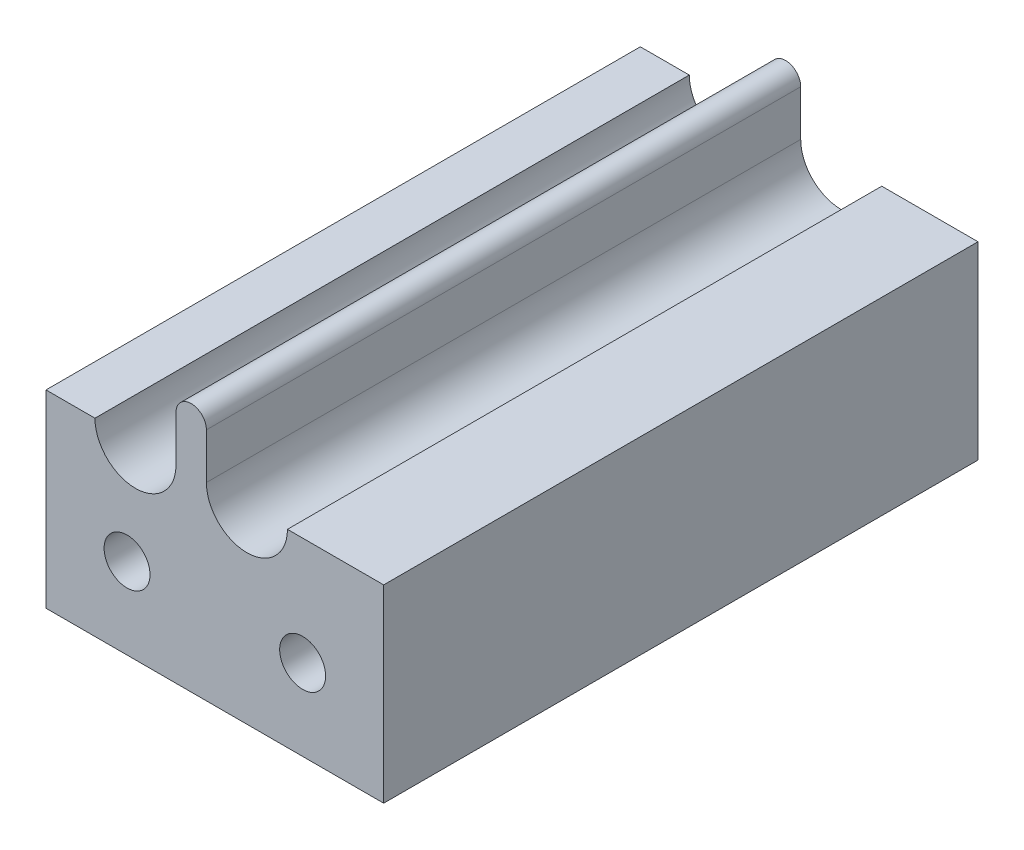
ISO-10303-21;
HEADER;
FILE_DESCRIPTION(('STEP AP214'),'2;1');
FILE_NAME('part.step','',(''),(''),'','','');
FILE_SCHEMA(('AUTOMOTIVE_DESIGN { 1 0 10303 214 1 1 1 1 }'));
ENDSEC;
DATA;
#1=APPLICATION_CONTEXT('core data for automotive mechanical design processes');
#2=APPLICATION_PROTOCOL_DEFINITION('international standard','automotive_design',2000,#1);
#3=PRODUCT_CONTEXT('',#1,'mechanical');
#4=PRODUCT('Part','Part','',(#3));
#5=PRODUCT_RELATED_PRODUCT_CATEGORY('part','',(#4));
#6=PRODUCT_DEFINITION_FORMATION('','',#4);
#7=PRODUCT_DEFINITION_CONTEXT('part definition',#1,'design');
#8=PRODUCT_DEFINITION('design','',#6,#7);
#9=PRODUCT_DEFINITION_SHAPE('','',#8);
#10=(LENGTH_UNIT() NAMED_UNIT(*) SI_UNIT(.MILLI.,.METRE.));
#11=(NAMED_UNIT(*) PLANE_ANGLE_UNIT() SI_UNIT($,.RADIAN.));
#12=(NAMED_UNIT(*) SI_UNIT($,.STERADIAN.) SOLID_ANGLE_UNIT());
#13=UNCERTAINTY_MEASURE_WITH_UNIT(LENGTH_MEASURE(1.E-05),#10,'distance_accuracy_value','');
#14=(GEOMETRIC_REPRESENTATION_CONTEXT(3) GLOBAL_UNCERTAINTY_ASSIGNED_CONTEXT((#13)) GLOBAL_UNIT_ASSIGNED_CONTEXT((#10,
#11,#12)) REPRESENTATION_CONTEXT('',''));
#15=CARTESIAN_POINT('',(0.,0.,0.));
#16=DIRECTION('',(0.,0.,1.));
#17=DIRECTION('',(1.,0.,0.));
#18=AXIS2_PLACEMENT_3D('',#15,#16,#17);
#19=CARTESIAN_POINT('',(-299.,-148.500000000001,-88.));
#20=DIRECTION('',(-1.,0.,0.));
#21=DIRECTION('',(0.,0.,1.));
#22=AXIS2_PLACEMENT_3D('',#19,#20,#21);
#23=PLANE('',#22);
#24=DIRECTION('',(0.,-1.,0.));
#25=VECTOR('',#24,1.);
#26=CARTESIAN_POINT('',(-299.,-148.500000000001,0.));
#27=LINE('',#26,#25);
#28=CARTESIAN_POINT('',(-299.,-148.500000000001,0.));
#29=VERTEX_POINT('',#28);
#30=CARTESIAN_POINT('',(-299.,-176.500000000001,0.));
#31=VERTEX_POINT('',#30);
#32=EDGE_CURVE('E195',#29,#31,#27,.T.);
#33=ORIENTED_EDGE('',*,*,#32,.F.);
#34=DIRECTION('',(0.,0.,1.));
#35=VECTOR('',#34,1.);
#36=CARTESIAN_POINT('',(-299.,-148.500000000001,-88.));
#37=LINE('',#36,#35);
#38=CARTESIAN_POINT('',(-299.,-148.500000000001,-88.));
#39=VERTEX_POINT('',#38);
#40=EDGE_CURVE('E13',#39,#29,#37,.T.);
#41=ORIENTED_EDGE('',*,*,#40,.F.);
#42=DIRECTION('',(0.,-1.,0.));
#43=VECTOR('',#42,1.);
#44=CARTESIAN_POINT('',(-299.,-148.500000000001,-88.));
#45=LINE('',#44,#43);
#46=CARTESIAN_POINT('',(-299.,-176.500000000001,-88.));
#47=VERTEX_POINT('',#46);
#48=EDGE_CURVE('E170',#39,#47,#45,.T.);
#49=ORIENTED_EDGE('',*,*,#48,.T.);
#50=DIRECTION('',(0.,0.,1.));
#51=VECTOR('',#50,1.);
#52=CARTESIAN_POINT('',(-299.,-176.500000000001,-88.));
#53=LINE('',#52,#51);
#54=EDGE_CURVE('E50',#47,#31,#53,.T.);
#55=ORIENTED_EDGE('',*,*,#54,.T.);
#56=EDGE_LOOP('',(#33,#41,#49,#55));
#57=FACE_BOUND('',#56,.T.);
#58=ADVANCED_FACE('F47',(#57),#23,.T.);
#59=CARTESIAN_POINT('',(-291.75,-148.500000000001,-88.));
#60=DIRECTION('',(0.,1.,0.));
#61=DIRECTION('',(-1.,0.,0.));
#62=AXIS2_PLACEMENT_3D('',#59,#60,#61);
#63=PLANE('',#62);
#64=DIRECTION('',(-1.,0.,0.));
#65=VECTOR('',#64,1.);
#66=CARTESIAN_POINT('',(-291.75,-148.500000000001,0.));
#67=LINE('',#66,#65);
#68=CARTESIAN_POINT('',(-291.75,-148.500000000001,0.));
#69=VERTEX_POINT('',#68);
#70=EDGE_CURVE('E162',#69,#29,#67,.T.);
#71=ORIENTED_EDGE('',*,*,#70,.F.);
#72=DIRECTION('',(0.,0.,1.));
#73=VECTOR('',#72,1.);
#74=CARTESIAN_POINT('',(-291.75,-148.500000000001,-88.));
#75=LINE('',#74,#73);
#76=CARTESIAN_POINT('',(-291.75,-148.500000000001,-88.));
#77=VERTEX_POINT('',#76);
#78=EDGE_CURVE('E55',#77,#69,#75,.T.);
#79=ORIENTED_EDGE('',*,*,#78,.F.);
#80=DIRECTION('',(-1.,0.,0.));
#81=VECTOR('',#80,1.);
#82=CARTESIAN_POINT('',(-291.75,-148.500000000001,-88.));
#83=LINE('',#82,#81);
#84=EDGE_CURVE('E184',#77,#39,#83,.T.);
#85=ORIENTED_EDGE('',*,*,#84,.T.);
#86=ORIENTED_EDGE('',*,*,#40,.T.);
#87=EDGE_LOOP('',(#71,#79,#85,#86));
#88=FACE_BOUND('',#87,.T.);
#89=ADVANCED_FACE('F254',(#88),#63,.T.);
#90=CARTESIAN_POINT('',(-285.75,-148.500000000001,-88.));
#91=DIRECTION('',(0.,0.,1.));
#92=DIRECTION('',(1.,0.,0.));
#93=AXIS2_PLACEMENT_3D('',#90,#91,#92);
#94=CYLINDRICAL_SURFACE('',#93,6.00000000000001);
#95=CARTESIAN_POINT('',(-285.75,-148.500000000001,0.));
#96=DIRECTION('',(0.,0.,-1.));
#97=DIRECTION('',(1.,0.,0.));
#98=AXIS2_PLACEMENT_3D('',#95,#96,#97);
#99=CIRCLE('',#98,6.00000000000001);
#100=CARTESIAN_POINT('',(-279.75,-148.500000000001,0.));
#101=VERTEX_POINT('',#100);
#102=EDGE_CURVE('E159',#101,#69,#99,.T.);
#103=ORIENTED_EDGE('',*,*,#102,.F.);
#104=DIRECTION('',(0.,0.,1.));
#105=VECTOR('',#104,1.);
#106=CARTESIAN_POINT('',(-279.75,-148.500000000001,-88.));
#107=LINE('',#106,#105);
#108=CARTESIAN_POINT('',(-279.75,-148.500000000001,-88.));
#109=VERTEX_POINT('',#108);
#110=EDGE_CURVE('E151',#109,#101,#107,.T.);
#111=ORIENTED_EDGE('',*,*,#110,.F.);
#112=CARTESIAN_POINT('',(-285.75,-148.500000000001,-88.));
#113=DIRECTION('',(0.,0.,-1.));
#114=DIRECTION('',(1.,0.,0.));
#115=AXIS2_PLACEMENT_3D('',#112,#113,#114);
#116=CIRCLE('',#115,6.00000000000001);
#117=EDGE_CURVE('E182',#109,#77,#116,.T.);
#118=ORIENTED_EDGE('',*,*,#117,.T.);
#119=ORIENTED_EDGE('',*,*,#78,.T.);
#120=EDGE_LOOP('',(#103,#111,#118,#119));
#121=FACE_BOUND('',#120,.T.);
#122=ADVANCED_FACE('F258',(#121),#94,.F.);
#123=CARTESIAN_POINT('',(-269.25,-148.500000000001,-88.));
#124=DIRECTION('',(0.,0.,1.));
#125=DIRECTION('',(1.,0.,0.));
#126=AXIS2_PLACEMENT_3D('',#123,#124,#125);
#127=CYLINDRICAL_SURFACE('',#126,6.00000000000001);
#128=CARTESIAN_POINT('',(-269.25,-148.500000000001,0.));
#129=DIRECTION('',(0.,0.,-1.));
#130=DIRECTION('',(1.,0.,0.));
#131=AXIS2_PLACEMENT_3D('',#128,#129,#130);
#132=CIRCLE('',#131,6.00000000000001);
#133=CARTESIAN_POINT('',(-263.25,-148.500000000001,0.));
#134=VERTEX_POINT('',#133);
#135=CARTESIAN_POINT('',(-275.25,-148.500000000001,0.));
#136=VERTEX_POINT('',#135);
#137=EDGE_CURVE('E147',#134,#136,#132,.T.);
#138=ORIENTED_EDGE('',*,*,#137,.F.);
#139=DIRECTION('',(0.,0.,1.));
#140=VECTOR('',#139,1.);
#141=CARTESIAN_POINT('',(-263.25,-148.500000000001,-88.));
#142=LINE('',#141,#140);
#143=CARTESIAN_POINT('',(-263.25,-148.500000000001,-88.));
#144=VERTEX_POINT('',#143);
#145=EDGE_CURVE('E152',#144,#134,#142,.T.);
#146=ORIENTED_EDGE('',*,*,#145,.F.);
#147=CARTESIAN_POINT('',(-269.25,-148.500000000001,-88.));
#148=DIRECTION('',(0.,0.,-1.));
#149=DIRECTION('',(1.,0.,0.));
#150=AXIS2_PLACEMENT_3D('',#147,#148,#149);
#151=CIRCLE('',#150,6.00000000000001);
#152=CARTESIAN_POINT('',(-275.25,-148.500000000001,-88.));
#153=VERTEX_POINT('',#152);
#154=EDGE_CURVE('E150',#144,#153,#151,.T.);
#155=ORIENTED_EDGE('',*,*,#154,.T.);
#156=DIRECTION('',(0.,0.,1.));
#157=VECTOR('',#156,1.);
#158=CARTESIAN_POINT('',(-275.25,-148.500000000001,-88.));
#159=LINE('',#158,#157);
#160=EDGE_CURVE('E133',#153,#136,#159,.T.);
#161=ORIENTED_EDGE('',*,*,#160,.T.);
#162=EDGE_LOOP('',(#138,#146,#155,#161));
#163=FACE_BOUND('',#162,.T.);
#164=ADVANCED_FACE('F146',(#163),#127,.F.);
#165=CARTESIAN_POINT('',(-249.,-148.500000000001,-88.));
#166=DIRECTION('',(0.,1.,0.));
#167=DIRECTION('',(-1.,0.,0.));
#168=AXIS2_PLACEMENT_3D('',#165,#166,#167);
#169=PLANE('',#168);
#170=DIRECTION('',(-1.,0.,0.));
#171=VECTOR('',#170,1.);
#172=CARTESIAN_POINT('',(-249.,-148.500000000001,0.));
#173=LINE('',#172,#171);
#174=CARTESIAN_POINT('',(-249.,-148.500000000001,0.));
#175=VERTEX_POINT('',#174);
#176=EDGE_CURVE('E158',#175,#134,#173,.T.);
#177=ORIENTED_EDGE('',*,*,#176,.F.);
#178=DIRECTION('',(0.,0.,1.));
#179=VECTOR('',#178,1.);
#180=CARTESIAN_POINT('',(-249.,-148.500000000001,-88.));
#181=LINE('',#180,#179);
#182=CARTESIAN_POINT('',(-249.,-148.500000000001,-88.));
#183=VERTEX_POINT('',#182);
#184=EDGE_CURVE('E190',#183,#175,#181,.T.);
#185=ORIENTED_EDGE('',*,*,#184,.F.);
#186=DIRECTION('',(-1.,0.,0.));
#187=VECTOR('',#186,1.);
#188=CARTESIAN_POINT('',(-249.,-148.500000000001,-88.));
#189=LINE('',#188,#187);
#190=EDGE_CURVE('E178',#183,#144,#189,.T.);
#191=ORIENTED_EDGE('',*,*,#190,.T.);
#192=ORIENTED_EDGE('',*,*,#145,.T.);
#193=EDGE_LOOP('',(#177,#185,#191,#192));
#194=FACE_BOUND('',#193,.T.);
#195=ADVANCED_FACE('F212',(#194),#169,.T.);
#196=CARTESIAN_POINT('',(-249.,-176.500000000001,-88.));
#197=DIRECTION('',(1.,0.,0.));
#198=DIRECTION('',(0.,0.,-1.));
#199=AXIS2_PLACEMENT_3D('',#196,#197,#198);
#200=PLANE('',#199);
#201=DIRECTION('',(0.,1.,0.));
#202=VECTOR('',#201,1.);
#203=CARTESIAN_POINT('',(-249.,-176.500000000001,0.));
#204=LINE('',#203,#202);
#205=CARTESIAN_POINT('',(-249.,-176.500000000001,0.));
#206=VERTEX_POINT('',#205);
#207=EDGE_CURVE('E164',#206,#175,#204,.T.);
#208=ORIENTED_EDGE('',*,*,#207,.F.);
#209=DIRECTION('',(0.,0.,1.));
#210=VECTOR('',#209,1.);
#211=CARTESIAN_POINT('',(-249.,-176.500000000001,-88.));
#212=LINE('',#211,#210);
#213=CARTESIAN_POINT('',(-249.,-176.500000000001,-88.));
#214=VERTEX_POINT('',#213);
#215=EDGE_CURVE('E191',#214,#206,#212,.T.);
#216=ORIENTED_EDGE('',*,*,#215,.F.);
#217=DIRECTION('',(0.,1.,0.));
#218=VECTOR('',#217,1.);
#219=CARTESIAN_POINT('',(-249.,-176.500000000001,-88.));
#220=LINE('',#219,#218);
#221=EDGE_CURVE('E175',#214,#183,#220,.T.);
#222=ORIENTED_EDGE('',*,*,#221,.T.);
#223=ORIENTED_EDGE('',*,*,#184,.T.);
#224=EDGE_LOOP('',(#208,#216,#222,#223));
#225=FACE_BOUND('',#224,.T.);
#226=ADVANCED_FACE('F208',(#225),#200,.T.);
#227=CARTESIAN_POINT('',(-299.,-176.500000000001,-88.));
#228=DIRECTION('',(0.,-1.,0.));
#229=DIRECTION('',(1.,0.,0.));
#230=AXIS2_PLACEMENT_3D('',#227,#228,#229);
#231=PLANE('',#230);
#232=DIRECTION('',(1.,0.,0.));
#233=VECTOR('',#232,1.);
#234=CARTESIAN_POINT('',(-299.,-176.500000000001,0.));
#235=LINE('',#234,#233);
#236=EDGE_CURVE('E198',#31,#206,#235,.T.);
#237=ORIENTED_EDGE('',*,*,#236,.F.);
#238=ORIENTED_EDGE('',*,*,#54,.F.);
#239=DIRECTION('',(1.,0.,0.));
#240=VECTOR('',#239,1.);
#241=CARTESIAN_POINT('',(-299.,-176.500000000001,-88.));
#242=LINE('',#241,#240);
#243=EDGE_CURVE('E172',#47,#214,#242,.T.);
#244=ORIENTED_EDGE('',*,*,#243,.T.);
#245=ORIENTED_EDGE('',*,*,#215,.T.);
#246=EDGE_LOOP('',(#237,#238,#244,#245));
#247=FACE_BOUND('',#246,.T.);
#248=ADVANCED_FACE('F199',(#247),#231,.T.);
#249=CARTESIAN_POINT('',(-269.25,-148.500000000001,-88.));
#250=DIRECTION('',(0.,0.,1.));
#251=DIRECTION('',(1.,0.,0.));
#252=AXIS2_PLACEMENT_3D('',#249,#250,#251);
#253=PLANE('',#252);
#254=ORIENTED_EDGE('',*,*,#48,.F.);
#255=ORIENTED_EDGE('',*,*,#84,.F.);
#256=ORIENTED_EDGE('',*,*,#117,.F.);
#257=DIRECTION('',(0.,-1.,0.));
#258=VECTOR('',#257,1.);
#259=CARTESIAN_POINT('',(-279.75,-148.500000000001,-88.));
#260=LINE('',#259,#258);
#261=CARTESIAN_POINT('',(-279.75,-141.750000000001,-88.));
#262=VERTEX_POINT('',#261);
#263=EDGE_CURVE('E220',#262,#109,#260,.T.);
#264=ORIENTED_EDGE('',*,*,#263,.F.);
#265=CARTESIAN_POINT('',(-277.5,-141.750000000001,-88.));
#266=DIRECTION('',(0.,0.,1.));
#267=DIRECTION('',(-1.,0.,0.));
#268=AXIS2_PLACEMENT_3D('',#265,#266,#267);
#269=CIRCLE('',#268,2.24999999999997);
#270=CARTESIAN_POINT('',(-275.25,-141.750000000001,-88.));
#271=VERTEX_POINT('',#270);
#272=EDGE_CURVE('E219',#271,#262,#269,.T.);
#273=ORIENTED_EDGE('',*,*,#272,.F.);
#274=DIRECTION('',(0.,1.,0.));
#275=VECTOR('',#274,1.);
#276=CARTESIAN_POINT('',(-275.25,-148.500000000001,-88.));
#277=LINE('',#276,#275);
#278=EDGE_CURVE('E216',#153,#271,#277,.T.);
#279=ORIENTED_EDGE('',*,*,#278,.F.);
#280=ORIENTED_EDGE('',*,*,#154,.F.);
#281=ORIENTED_EDGE('',*,*,#190,.F.);
#282=ORIENTED_EDGE('',*,*,#221,.F.);
#283=ORIENTED_EDGE('',*,*,#243,.F.);
#284=EDGE_LOOP('',(#254,#255,#256,#264,#273,#279,#280,#281,#282,#283));
#285=FACE_BOUND('',#284,.T.);
#286=ADVANCED_FACE('F214',(#285),#253,.F.);
#287=CARTESIAN_POINT('',(-269.25,-148.500000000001,0.));
#288=DIRECTION('',(0.,0.,1.));
#289=DIRECTION('',(1.,0.,0.));
#290=AXIS2_PLACEMENT_3D('',#287,#288,#289);
#291=PLANE('',#290);
#292=CARTESIAN_POINT('',(-261.,-164.500000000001,0.));
#293=DIRECTION('',(0.,0.,1.));
#294=DIRECTION('',(1.,0.,0.));
#295=AXIS2_PLACEMENT_3D('',#292,#293,#294);
#296=CIRCLE('',#295,3.40000000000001);
#297=CARTESIAN_POINT('',(-257.6,-164.500000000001,0.));
#298=VERTEX_POINT('',#297);
#299=EDGE_CURVE('E232',#298,#298,#296,.T.);
#300=ORIENTED_EDGE('',*,*,#299,.F.);
#301=EDGE_LOOP('',(#300));
#302=FACE_BOUND('',#301,.T.);
#303=CARTESIAN_POINT('',(-287.,-164.500000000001,0.));
#304=DIRECTION('',(0.,0.,1.));
#305=DIRECTION('',(1.,0.,0.));
#306=AXIS2_PLACEMENT_3D('',#303,#304,#305);
#307=CIRCLE('',#306,3.40000000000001);
#308=CARTESIAN_POINT('',(-283.6,-164.500000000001,0.));
#309=VERTEX_POINT('',#308);
#310=EDGE_CURVE('E201',#309,#309,#307,.T.);
#311=ORIENTED_EDGE('',*,*,#310,.F.);
#312=EDGE_LOOP('',(#311));
#313=FACE_BOUND('',#312,.T.);
#314=ORIENTED_EDGE('',*,*,#32,.T.);
#315=ORIENTED_EDGE('',*,*,#236,.T.);
#316=ORIENTED_EDGE('',*,*,#207,.T.);
#317=ORIENTED_EDGE('',*,*,#176,.T.);
#318=ORIENTED_EDGE('',*,*,#137,.T.);
#319=DIRECTION('',(0.,1.,0.));
#320=VECTOR('',#319,1.);
#321=CARTESIAN_POINT('',(-275.25,-148.500000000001,0.));
#322=LINE('',#321,#320);
#323=CARTESIAN_POINT('',(-275.25,-141.750000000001,0.));
#324=VERTEX_POINT('',#323);
#325=EDGE_CURVE('E129',#136,#324,#322,.T.);
#326=ORIENTED_EDGE('',*,*,#325,.T.);
#327=CARTESIAN_POINT('',(-277.5,-141.750000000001,0.));
#328=DIRECTION('',(0.,0.,1.));
#329=DIRECTION('',(-1.,0.,0.));
#330=AXIS2_PLACEMENT_3D('',#327,#328,#329);
#331=CIRCLE('',#330,2.24999999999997);
#332=CARTESIAN_POINT('',(-279.75,-141.750000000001,0.));
#333=VERTEX_POINT('',#332);
#334=EDGE_CURVE('E140',#324,#333,#331,.T.);
#335=ORIENTED_EDGE('',*,*,#334,.T.);
#336=DIRECTION('',(0.,-1.,0.));
#337=VECTOR('',#336,1.);
#338=CARTESIAN_POINT('',(-279.75,-148.500000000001,0.));
#339=LINE('',#338,#337);
#340=EDGE_CURVE('E141',#333,#101,#339,.T.);
#341=ORIENTED_EDGE('',*,*,#340,.T.);
#342=ORIENTED_EDGE('',*,*,#102,.T.);
#343=ORIENTED_EDGE('',*,*,#70,.T.);
#344=EDGE_LOOP('',(#314,#315,#316,#317,#318,#326,#335,#341,#342,#343));
#345=FACE_BOUND('',#344,.T.);
#346=ADVANCED_FACE('F155',(#302,#313,#345),#291,.T.);
#347=CARTESIAN_POINT('',(-287.,-164.500000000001,0.));
#348=DIRECTION('',(0.,0.,1.));
#349=DIRECTION('',(1.,0.,0.));
#350=AXIS2_PLACEMENT_3D('',#347,#348,#349);
#351=CYLINDRICAL_SURFACE('',#350,3.40000000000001);
#352=CARTESIAN_POINT('',(-287.,-164.500000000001,-30.));
#353=DIRECTION('',(0.,0.,1.));
#354=DIRECTION('',(1.,0.,0.));
#355=AXIS2_PLACEMENT_3D('',#352,#353,#354);
#356=CIRCLE('',#355,3.40000000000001);
#357=CARTESIAN_POINT('',(-283.6,-164.500000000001,-30.));
#358=VERTEX_POINT('',#357);
#359=EDGE_CURVE('E204',#358,#358,#356,.T.);
#360=ORIENTED_EDGE('',*,*,#359,.F.);
#361=EDGE_LOOP('',(#360));
#362=FACE_BOUND('',#361,.T.);
#363=ORIENTED_EDGE('',*,*,#310,.T.);
#364=EDGE_LOOP('',(#363));
#365=FACE_BOUND('',#364,.T.);
#366=ADVANCED_FACE('F239',(#362,#365),#351,.F.);
#367=CARTESIAN_POINT('',(-287.,-164.500000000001,-30.));
#368=DIRECTION('',(0.,0.,1.));
#369=DIRECTION('',(1.,0.,0.));
#370=AXIS2_PLACEMENT_3D('',#367,#368,#369);
#371=CONICAL_SURFACE('',#370,3.40000000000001,1.02974425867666);
#372=CARTESIAN_POINT('',(-287.,-164.500000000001,-32.0429261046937));
#373=VERTEX_POINT('',#372);
#374=VERTEX_LOOP('',#373);
#375=FACE_BOUND('',#374,.T.);
#376=ORIENTED_EDGE('',*,*,#359,.T.);
#377=EDGE_LOOP('',(#376));
#378=FACE_BOUND('',#377,.T.);
#379=ADVANCED_FACE('F237',(#375,#378),#371,.F.);
#380=CARTESIAN_POINT('',(-261.,-164.500000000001,0.));
#381=DIRECTION('',(0.,0.,1.));
#382=DIRECTION('',(1.,0.,0.));
#383=AXIS2_PLACEMENT_3D('',#380,#381,#382);
#384=CYLINDRICAL_SURFACE('',#383,3.40000000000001);
#385=CARTESIAN_POINT('',(-261.,-164.500000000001,-30.));
#386=DIRECTION('',(0.,0.,1.));
#387=DIRECTION('',(1.,0.,0.));
#388=AXIS2_PLACEMENT_3D('',#385,#386,#387);
#389=CIRCLE('',#388,3.40000000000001);
#390=CARTESIAN_POINT('',(-257.6,-164.500000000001,-30.));
#391=VERTEX_POINT('',#390);
#392=EDGE_CURVE('E228',#391,#391,#389,.T.);
#393=ORIENTED_EDGE('',*,*,#392,.F.);
#394=EDGE_LOOP('',(#393));
#395=FACE_BOUND('',#394,.T.);
#396=ORIENTED_EDGE('',*,*,#299,.T.);
#397=EDGE_LOOP('',(#396));
#398=FACE_BOUND('',#397,.T.);
#399=ADVANCED_FACE('F328',(#395,#398),#384,.F.);
#400=CARTESIAN_POINT('',(-261.,-164.500000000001,-30.));
#401=DIRECTION('',(0.,0.,1.));
#402=DIRECTION('',(1.,0.,0.));
#403=AXIS2_PLACEMENT_3D('',#400,#401,#402);
#404=CONICAL_SURFACE('',#403,3.40000000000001,1.02974425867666);
#405=CARTESIAN_POINT('',(-261.,-164.500000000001,-32.0429261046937));
#406=VERTEX_POINT('',#405);
#407=VERTEX_LOOP('',#406);
#408=FACE_BOUND('',#407,.T.);
#409=ORIENTED_EDGE('',*,*,#392,.T.);
#410=EDGE_LOOP('',(#409));
#411=FACE_BOUND('',#410,.T.);
#412=ADVANCED_FACE('F303',(#408,#411),#404,.F.);
#413=CARTESIAN_POINT('',(-279.75,-148.500000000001,-88.));
#414=DIRECTION('',(-1.,0.,0.));
#415=DIRECTION('',(0.,0.,1.));
#416=AXIS2_PLACEMENT_3D('',#413,#414,#415);
#417=PLANE('',#416);
#418=ORIENTED_EDGE('',*,*,#340,.F.);
#419=DIRECTION('',(0.,0.,1.));
#420=VECTOR('',#419,1.);
#421=CARTESIAN_POINT('',(-279.75,-141.750000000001,-88.));
#422=LINE('',#421,#420);
#423=EDGE_CURVE('E226',#262,#333,#422,.T.);
#424=ORIENTED_EDGE('',*,*,#423,.F.);
#425=ORIENTED_EDGE('',*,*,#263,.T.);
#426=ORIENTED_EDGE('',*,*,#110,.T.);
#427=EDGE_LOOP('',(#418,#424,#425,#426));
#428=FACE_BOUND('',#427,.T.);
#429=ADVANCED_FACE('F298',(#428),#417,.T.);
#430=CARTESIAN_POINT('',(-277.5,-141.750000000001,-88.));
#431=DIRECTION('',(0.,0.,1.));
#432=DIRECTION('',(1.,0.,0.));
#433=AXIS2_PLACEMENT_3D('',#430,#431,#432);
#434=CYLINDRICAL_SURFACE('',#433,2.24999999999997);
#435=ORIENTED_EDGE('',*,*,#334,.F.);
#436=DIRECTION('',(0.,0.,1.));
#437=VECTOR('',#436,1.);
#438=CARTESIAN_POINT('',(-275.25,-141.750000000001,-88.));
#439=LINE('',#438,#437);
#440=EDGE_CURVE('E135',#271,#324,#439,.T.);
#441=ORIENTED_EDGE('',*,*,#440,.F.);
#442=ORIENTED_EDGE('',*,*,#272,.T.);
#443=ORIENTED_EDGE('',*,*,#423,.T.);
#444=EDGE_LOOP('',(#435,#441,#442,#443));
#445=FACE_BOUND('',#444,.T.);
#446=ADVANCED_FACE('F302',(#445),#434,.T.);
#447=CARTESIAN_POINT('',(-275.25,-148.500000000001,-88.));
#448=DIRECTION('',(1.,0.,0.));
#449=DIRECTION('',(0.,1.,0.));
#450=AXIS2_PLACEMENT_3D('',#447,#448,#449);
#451=PLANE('',#450);
#452=ORIENTED_EDGE('',*,*,#325,.F.);
#453=ORIENTED_EDGE('',*,*,#160,.F.);
#454=ORIENTED_EDGE('',*,*,#278,.T.);
#455=ORIENTED_EDGE('',*,*,#440,.T.);
#456=EDGE_LOOP('',(#452,#453,#454,#455));
#457=FACE_BOUND('',#456,.T.);
#458=ADVANCED_FACE('F131',(#457),#451,.T.);
#459=CLOSED_SHELL('',(#58,#89,#122,#164,#195,#226,#248,#286,#346,#366,#379,#399,#412,#429,#446,#458));
#460=MANIFOLD_SOLID_BREP('B2',#459);
#461=ADVANCED_BREP_SHAPE_REPRESENTATION('',(#18,#460),#14);
#462=SHAPE_DEFINITION_REPRESENTATION(#9,#461);
ENDSEC;
END-ISO-10303-21;
